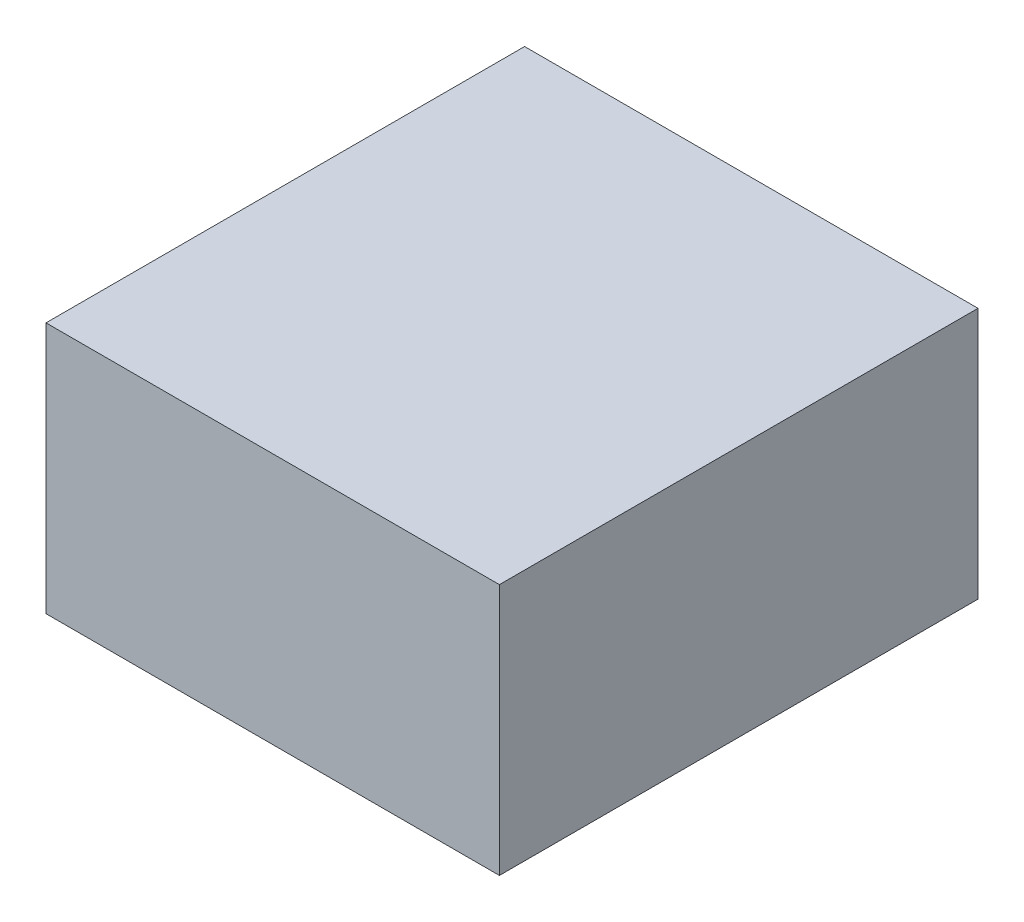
ISO-10303-21;
HEADER;
FILE_DESCRIPTION(('STEP AP214'),'2;1');
FILE_NAME('part.step','',(''),(''),'','','');
FILE_SCHEMA(('AUTOMOTIVE_DESIGN { 1 0 10303 214 1 1 1 1 }'));
ENDSEC;
DATA;
#1=APPLICATION_CONTEXT('core data for automotive mechanical design processes');
#2=APPLICATION_PROTOCOL_DEFINITION('international standard','automotive_design',2000,#1);
#3=PRODUCT_CONTEXT('',#1,'mechanical');
#4=PRODUCT('Part','Part','',(#3));
#5=PRODUCT_RELATED_PRODUCT_CATEGORY('part','',(#4));
#6=PRODUCT_DEFINITION_FORMATION('','',#4);
#7=PRODUCT_DEFINITION_CONTEXT('part definition',#1,'design');
#8=PRODUCT_DEFINITION('design','',#6,#7);
#9=PRODUCT_DEFINITION_SHAPE('','',#8);
#10=(LENGTH_UNIT() NAMED_UNIT(*) SI_UNIT(.MILLI.,.METRE.));
#11=(NAMED_UNIT(*) PLANE_ANGLE_UNIT() SI_UNIT($,.RADIAN.));
#12=(NAMED_UNIT(*) SI_UNIT($,.STERADIAN.) SOLID_ANGLE_UNIT());
#13=UNCERTAINTY_MEASURE_WITH_UNIT(LENGTH_MEASURE(1.E-05),#10,'distance_accuracy_value','');
#14=(GEOMETRIC_REPRESENTATION_CONTEXT(3) GLOBAL_UNCERTAINTY_ASSIGNED_CONTEXT((#13)) GLOBAL_UNIT_ASSIGNED_CONTEXT((#10,
#11,#12)) REPRESENTATION_CONTEXT('',''));
#15=CARTESIAN_POINT('',(0.,0.,0.));
#16=DIRECTION('',(0.,0.,1.));
#17=DIRECTION('',(1.,0.,0.));
#18=AXIS2_PLACEMENT_3D('',#15,#16,#17);
#19=CARTESIAN_POINT('',(45.,25.,95.));
#20=DIRECTION('',(-1.,0.,0.));
#21=DIRECTION('',(0.,-1.,0.));
#22=AXIS2_PLACEMENT_3D('',#19,#20,#21);
#23=PLANE('',#22);
#24=DIRECTION('',(0.,1.,0.));
#25=VECTOR('',#24,1.);
#26=CARTESIAN_POINT('',(45.,25.,0.));
#27=LINE('',#26,#25);
#28=CARTESIAN_POINT('',(45.,-25.,0.));
#29=VERTEX_POINT('',#28);
#30=CARTESIAN_POINT('',(45.,25.,0.));
#31=VERTEX_POINT('',#30);
#32=EDGE_CURVE('E107',#29,#31,#27,.T.);
#33=ORIENTED_EDGE('',*,*,#32,.T.);
#34=DIRECTION('',(0.,0.,-1.));
#35=VECTOR('',#34,1.);
#36=CARTESIAN_POINT('',(45.,25.,95.));
#37=LINE('',#36,#35);
#38=CARTESIAN_POINT('',(45.,25.,95.));
#39=VERTEX_POINT('',#38);
#40=EDGE_CURVE('E11',#39,#31,#37,.T.);
#41=ORIENTED_EDGE('',*,*,#40,.F.);
#42=DIRECTION('',(0.,1.,0.));
#43=VECTOR('',#42,1.);
#44=CARTESIAN_POINT('',(45.,25.,95.));
#45=LINE('',#44,#43);
#46=CARTESIAN_POINT('',(45.,-25.,95.));
#47=VERTEX_POINT('',#46);
#48=EDGE_CURVE('E91',#47,#39,#45,.T.);
#49=ORIENTED_EDGE('',*,*,#48,.F.);
#50=DIRECTION('',(0.,0.,-1.));
#51=VECTOR('',#50,1.);
#52=CARTESIAN_POINT('',(45.,-25.,95.));
#53=LINE('',#52,#51);
#54=EDGE_CURVE('E103',#47,#29,#53,.T.);
#55=ORIENTED_EDGE('',*,*,#54,.T.);
#56=EDGE_LOOP('',(#33,#41,#49,#55));
#57=FACE_BOUND('',#56,.T.);
#58=ADVANCED_FACE('F39',(#57),#23,.F.);
#59=CARTESIAN_POINT('',(-45.,25.,95.));
#60=DIRECTION('',(0.,-1.,0.));
#61=DIRECTION('',(0.,0.,-1.));
#62=AXIS2_PLACEMENT_3D('',#59,#60,#61);
#63=PLANE('',#62);
#64=DIRECTION('',(-1.,0.,0.));
#65=VECTOR('',#64,1.);
#66=CARTESIAN_POINT('',(-45.,25.,0.));
#67=LINE('',#66,#65);
#68=CARTESIAN_POINT('',(-45.,25.,0.));
#69=VERTEX_POINT('',#68);
#70=EDGE_CURVE('E96',#31,#69,#67,.T.);
#71=ORIENTED_EDGE('',*,*,#70,.T.);
#72=DIRECTION('',(0.,0.,-1.));
#73=VECTOR('',#72,1.);
#74=CARTESIAN_POINT('',(-45.,25.,95.));
#75=LINE('',#74,#73);
#76=CARTESIAN_POINT('',(-45.,25.,95.));
#77=VERTEX_POINT('',#76);
#78=EDGE_CURVE('E48',#77,#69,#75,.T.);
#79=ORIENTED_EDGE('',*,*,#78,.F.);
#80=DIRECTION('',(-1.,0.,0.));
#81=VECTOR('',#80,1.);
#82=CARTESIAN_POINT('',(-45.,25.,95.));
#83=LINE('',#82,#81);
#84=EDGE_CURVE('E86',#39,#77,#83,.T.);
#85=ORIENTED_EDGE('',*,*,#84,.F.);
#86=ORIENTED_EDGE('',*,*,#40,.T.);
#87=EDGE_LOOP('',(#71,#79,#85,#86));
#88=FACE_BOUND('',#87,.T.);
#89=ADVANCED_FACE('F95',(#88),#63,.F.);
#90=CARTESIAN_POINT('',(-45.,25.,95.));
#91=DIRECTION('',(1.,0.,0.));
#92=DIRECTION('',(0.,1.,0.));
#93=AXIS2_PLACEMENT_3D('',#90,#91,#92);
#94=PLANE('',#93);
#95=DIRECTION('',(0.,-1.,0.));
#96=VECTOR('',#95,1.);
#97=CARTESIAN_POINT('',(-45.,25.,0.));
#98=LINE('',#97,#96);
#99=CARTESIAN_POINT('',(-45.,-25.,0.));
#100=VERTEX_POINT('',#99);
#101=EDGE_CURVE('E73',#69,#100,#98,.T.);
#102=ORIENTED_EDGE('',*,*,#101,.T.);
#103=DIRECTION('',(0.,0.,-1.));
#104=VECTOR('',#103,1.);
#105=CARTESIAN_POINT('',(-45.,-25.,95.));
#106=LINE('',#105,#104);
#107=CARTESIAN_POINT('',(-45.,-25.,95.));
#108=VERTEX_POINT('',#107);
#109=EDGE_CURVE('E98',#108,#100,#106,.T.);
#110=ORIENTED_EDGE('',*,*,#109,.F.);
#111=DIRECTION('',(0.,-1.,0.));
#112=VECTOR('',#111,1.);
#113=CARTESIAN_POINT('',(-45.,25.,95.));
#114=LINE('',#113,#112);
#115=EDGE_CURVE('E89',#77,#108,#114,.T.);
#116=ORIENTED_EDGE('',*,*,#115,.F.);
#117=ORIENTED_EDGE('',*,*,#78,.T.);
#118=EDGE_LOOP('',(#102,#110,#116,#117));
#119=FACE_BOUND('',#118,.T.);
#120=ADVANCED_FACE('F99',(#119),#94,.F.);
#121=CARTESIAN_POINT('',(-45.,-25.,95.));
#122=DIRECTION('',(0.,1.,0.));
#123=DIRECTION('',(0.,0.,1.));
#124=AXIS2_PLACEMENT_3D('',#121,#122,#123);
#125=PLANE('',#124);
#126=DIRECTION('',(1.,0.,0.));
#127=VECTOR('',#126,1.);
#128=CARTESIAN_POINT('',(-45.,-25.,0.));
#129=LINE('',#128,#127);
#130=EDGE_CURVE('E79',#100,#29,#129,.T.);
#131=ORIENTED_EDGE('',*,*,#130,.T.);
#132=ORIENTED_EDGE('',*,*,#54,.F.);
#133=DIRECTION('',(1.,0.,0.));
#134=VECTOR('',#133,1.);
#135=CARTESIAN_POINT('',(-45.,-25.,95.));
#136=LINE('',#135,#134);
#137=EDGE_CURVE('E56',#108,#47,#136,.T.);
#138=ORIENTED_EDGE('',*,*,#137,.F.);
#139=ORIENTED_EDGE('',*,*,#109,.T.);
#140=EDGE_LOOP('',(#131,#132,#138,#139));
#141=FACE_BOUND('',#140,.T.);
#142=ADVANCED_FACE('F120',(#141),#125,.F.);
#143=CARTESIAN_POINT('',(0.,0.,95.));
#144=DIRECTION('',(0.,0.,1.));
#145=DIRECTION('',(1.,0.,0.));
#146=AXIS2_PLACEMENT_3D('',#143,#144,#145);
#147=PLANE('',#146);
#148=ORIENTED_EDGE('',*,*,#48,.T.);
#149=ORIENTED_EDGE('',*,*,#84,.T.);
#150=ORIENTED_EDGE('',*,*,#115,.T.);
#151=ORIENTED_EDGE('',*,*,#137,.T.);
#152=EDGE_LOOP('',(#148,#149,#150,#151));
#153=FACE_BOUND('',#152,.T.);
#154=ADVANCED_FACE('F87',(#153),#147,.T.);
#155=CARTESIAN_POINT('',(0.,0.,0.));
#156=DIRECTION('',(0.,0.,1.));
#157=DIRECTION('',(1.,0.,0.));
#158=AXIS2_PLACEMENT_3D('',#155,#156,#157);
#159=PLANE('',#158);
#160=ORIENTED_EDGE('',*,*,#32,.F.);
#161=ORIENTED_EDGE('',*,*,#130,.F.);
#162=ORIENTED_EDGE('',*,*,#101,.F.);
#163=ORIENTED_EDGE('',*,*,#70,.F.);
#164=EDGE_LOOP('',(#160,#161,#162,#163));
#165=FACE_BOUND('',#164,.T.);
#166=ADVANCED_FACE('F123',(#165),#159,.F.);
#167=CLOSED_SHELL('',(#58,#89,#120,#142,#154,#166));
#168=MANIFOLD_SOLID_BREP('B2',#167);
#169=ADVANCED_BREP_SHAPE_REPRESENTATION('',(#18,#168),#14);
#170=SHAPE_DEFINITION_REPRESENTATION(#9,#169);
ENDSEC;
END-ISO-10303-21;
